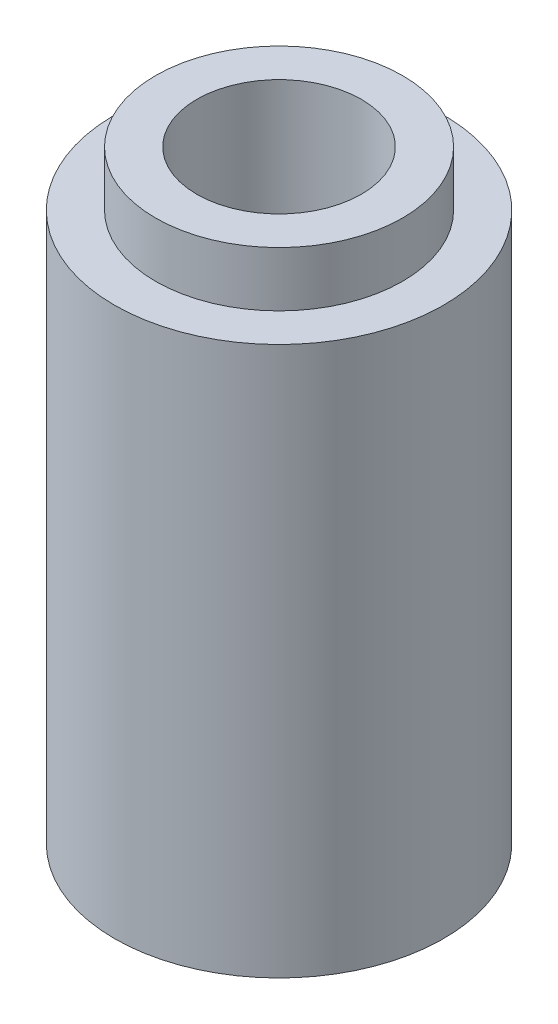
ISO-10303-21;
HEADER;
FILE_DESCRIPTION(('STEP AP214'),'2;1');
FILE_NAME('part.step','',(''),(''),'','','');
FILE_SCHEMA(('AUTOMOTIVE_DESIGN { 1 0 10303 214 1 1 1 1 }'));
ENDSEC;
DATA;
#1=APPLICATION_CONTEXT('core data for automotive mechanical design processes');
#2=APPLICATION_PROTOCOL_DEFINITION('international standard','automotive_design',2000,#1);
#3=PRODUCT_CONTEXT('',#1,'mechanical');
#4=PRODUCT('Part','Part','',(#3));
#5=PRODUCT_RELATED_PRODUCT_CATEGORY('part','',(#4));
#6=PRODUCT_DEFINITION_FORMATION('','',#4);
#7=PRODUCT_DEFINITION_CONTEXT('part definition',#1,'design');
#8=PRODUCT_DEFINITION('design','',#6,#7);
#9=PRODUCT_DEFINITION_SHAPE('','',#8);
#10=(LENGTH_UNIT() NAMED_UNIT(*) SI_UNIT(.MILLI.,.METRE.));
#11=(NAMED_UNIT(*) PLANE_ANGLE_UNIT() SI_UNIT($,.RADIAN.));
#12=(NAMED_UNIT(*) SI_UNIT($,.STERADIAN.) SOLID_ANGLE_UNIT());
#13=UNCERTAINTY_MEASURE_WITH_UNIT(LENGTH_MEASURE(1.E-05),#10,'distance_accuracy_value','');
#14=(GEOMETRIC_REPRESENTATION_CONTEXT(3) GLOBAL_UNCERTAINTY_ASSIGNED_CONTEXT((#13)) GLOBAL_UNIT_ASSIGNED_CONTEXT((#10,
#11,#12)) REPRESENTATION_CONTEXT('',''));
#15=CARTESIAN_POINT('',(0.,0.,0.));
#16=DIRECTION('',(0.,0.,1.));
#17=DIRECTION('',(1.,0.,0.));
#18=AXIS2_PLACEMENT_3D('',#15,#16,#17);
#19=CARTESIAN_POINT('',(0.,10.,0.));
#20=DIRECTION('',(0.,1.,0.));
#21=DIRECTION('',(0.,0.,1.));
#22=AXIS2_PLACEMENT_3D('',#19,#20,#21);
#23=PLANE('',#22);
#24=CARTESIAN_POINT('',(0.,10.,0.));
#25=DIRECTION('',(0.,1.,0.));
#26=DIRECTION('',(0.,0.,1.));
#27=AXIS2_PLACEMENT_3D('',#24,#25,#26);
#28=CIRCLE('',#27,3.);
#29=CARTESIAN_POINT('',(0.,10.,3.));
#30=VERTEX_POINT('',#29);
#31=EDGE_CURVE('E10',#30,#30,#28,.T.);
#32=ORIENTED_EDGE('',*,*,#31,.T.);
#33=EDGE_LOOP('',(#32));
#34=FACE_BOUND('',#33,.T.);
#35=CARTESIAN_POINT('',(0.,10.,0.));
#36=DIRECTION('',(0.,1.,0.));
#37=DIRECTION('',(0.,0.,1.));
#38=AXIS2_PLACEMENT_3D('',#35,#36,#37);
#39=CIRCLE('',#38,2.25);
#40=CARTESIAN_POINT('',(0.,10.,2.25));
#41=VERTEX_POINT('',#40);
#42=EDGE_CURVE('E42',#41,#41,#39,.T.);
#43=ORIENTED_EDGE('',*,*,#42,.F.);
#44=EDGE_LOOP('',(#43));
#45=FACE_BOUND('',#44,.T.);
#46=ADVANCED_FACE('F29',(#34,#45),#23,.T.);
#47=CARTESIAN_POINT('',(0.,10.,0.));
#48=DIRECTION('',(0.,-1.,0.));
#49=DIRECTION('',(0.,0.,-1.));
#50=AXIS2_PLACEMENT_3D('',#47,#48,#49);
#51=CYLINDRICAL_SURFACE('',#50,3.);
#52=ORIENTED_EDGE('',*,*,#31,.F.);
#53=EDGE_LOOP('',(#52));
#54=FACE_BOUND('',#53,.T.);
#55=CARTESIAN_POINT('',(0.,0.,0.));
#56=DIRECTION('',(0.,1.,0.));
#57=DIRECTION('',(0.,0.,1.));
#58=AXIS2_PLACEMENT_3D('',#55,#56,#57);
#59=CIRCLE('',#58,3.);
#60=CARTESIAN_POINT('',(0.,0.,3.));
#61=VERTEX_POINT('',#60);
#62=EDGE_CURVE('E33',#61,#61,#59,.T.);
#63=ORIENTED_EDGE('',*,*,#62,.T.);
#64=EDGE_LOOP('',(#63));
#65=FACE_BOUND('',#64,.T.);
#66=ADVANCED_FACE('F31',(#54,#65),#51,.T.);
#67=CARTESIAN_POINT('',(0.,0.,0.));
#68=DIRECTION('',(0.,1.,0.));
#69=DIRECTION('',(0.,0.,1.));
#70=AXIS2_PLACEMENT_3D('',#67,#68,#69);
#71=PLANE('',#70);
#72=CARTESIAN_POINT('',(0.,0.,0.));
#73=DIRECTION('',(0.,-1.,0.));
#74=DIRECTION('',(0.,0.,-1.));
#75=AXIS2_PLACEMENT_3D('',#72,#73,#74);
#76=CIRCLE('',#75,1.5);
#77=CARTESIAN_POINT('',(0.,0.,-1.5));
#78=VERTEX_POINT('',#77);
#79=EDGE_CURVE('E50',#78,#78,#76,.T.);
#80=ORIENTED_EDGE('',*,*,#79,.F.);
#81=EDGE_LOOP('',(#80));
#82=FACE_BOUND('',#81,.T.);
#83=ORIENTED_EDGE('',*,*,#62,.F.);
#84=EDGE_LOOP('',(#83));
#85=FACE_BOUND('',#84,.T.);
#86=ADVANCED_FACE('F57',(#82,#85),#71,.F.);
#87=CARTESIAN_POINT('',(0.,11.,0.));
#88=DIRECTION('',(0.,-1.,0.));
#89=DIRECTION('',(0.,0.,-1.));
#90=AXIS2_PLACEMENT_3D('',#87,#88,#89);
#91=CYLINDRICAL_SURFACE('',#90,2.25);
#92=CARTESIAN_POINT('',(0.,11.,0.));
#93=DIRECTION('',(0.,1.,0.));
#94=DIRECTION('',(0.,0.,1.));
#95=AXIS2_PLACEMENT_3D('',#92,#93,#94);
#96=CIRCLE('',#95,2.25);
#97=CARTESIAN_POINT('',(0.,11.,2.25));
#98=VERTEX_POINT('',#97);
#99=EDGE_CURVE('E40',#98,#98,#96,.T.);
#100=ORIENTED_EDGE('',*,*,#99,.F.);
#101=EDGE_LOOP('',(#100));
#102=FACE_BOUND('',#101,.T.);
#103=ORIENTED_EDGE('',*,*,#42,.T.);
#104=EDGE_LOOP('',(#103));
#105=FACE_BOUND('',#104,.T.);
#106=ADVANCED_FACE('F60',(#102,#105),#91,.T.);
#107=CARTESIAN_POINT('',(0.,11.,0.));
#108=DIRECTION('',(0.,1.,0.));
#109=DIRECTION('',(0.,0.,1.));
#110=AXIS2_PLACEMENT_3D('',#107,#108,#109);
#111=PLANE('',#110);
#112=CARTESIAN_POINT('',(0.,11.,0.));
#113=DIRECTION('',(0.,1.,0.));
#114=DIRECTION('',(0.,0.,1.));
#115=AXIS2_PLACEMENT_3D('',#112,#113,#114);
#116=CIRCLE('',#115,1.5);
#117=CARTESIAN_POINT('',(0.,11.,1.5));
#118=VERTEX_POINT('',#117);
#119=EDGE_CURVE('E45',#118,#118,#116,.F.);
#120=ORIENTED_EDGE('',*,*,#119,.T.);
#121=EDGE_LOOP('',(#120));
#122=FACE_BOUND('',#121,.T.);
#123=ORIENTED_EDGE('',*,*,#99,.T.);
#124=EDGE_LOOP('',(#123));
#125=FACE_BOUND('',#124,.T.);
#126=ADVANCED_FACE('F75',(#122,#125),#111,.T.);
#127=CARTESIAN_POINT('',(0.,15.2426406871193,0.));
#128=DIRECTION('',(0.,-1.,0.));
#129=DIRECTION('',(0.,0.,-1.));
#130=AXIS2_PLACEMENT_3D('',#127,#128,#129);
#131=CYLINDRICAL_SURFACE('',#130,1.5);
#132=ORIENTED_EDGE('',*,*,#79,.T.);
#133=EDGE_LOOP('',(#132));
#134=FACE_BOUND('',#133,.T.);
#135=ORIENTED_EDGE('',*,*,#119,.F.);
#136=EDGE_LOOP('',(#135));
#137=FACE_BOUND('',#136,.T.);
#138=ADVANCED_FACE('F54',(#134,#137),#131,.F.);
#139=CLOSED_SHELL('',(#46,#66,#86,#106,#126,#138));
#140=MANIFOLD_SOLID_BREP('B2',#139);
#141=ADVANCED_BREP_SHAPE_REPRESENTATION('',(#18,#140),#14);
#142=SHAPE_DEFINITION_REPRESENTATION(#9,#141);
ENDSEC;
END-ISO-10303-21;
